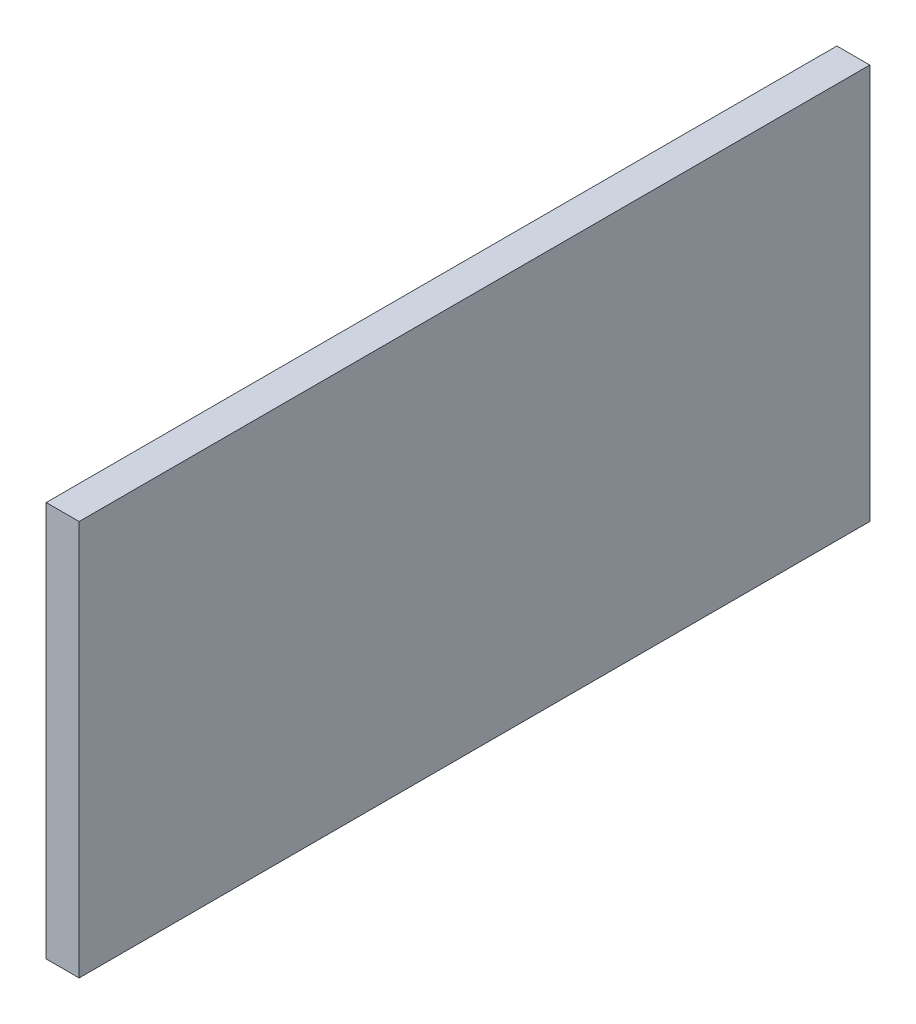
from build123d import *

# Parameters (mm, degrees)
BOSS_EXTRUDE1_DEPTH = 609.6
CUT_EXTRUDE1_REACH  = 1323.777
SKETCH2_W           = 50.8
SKETCH2_H           = 76.2
SKETCH3_W           = 76.2
SKETCH3_H           = 73.66
CUT_EXTRUDE2_DEPTH  = 50.8


with BuildPart() as part:
    # Sketch1 → Boss-Extrude1 (new body)
    with BuildSketch(Plane(origin=(0, 0, 0), x_dir=(1, 0, 0), z_dir=(0, 1, 0))):
        Polygon((0, 0), (50.8, 0), (50.8, -50.8), (101.6, -50.8), (101.6, 1168.4), (50.8, 1168.4), (50.8, 1117.6), (0, 1117.6), align=None)
    extrude(amount=BOSS_EXTRUDE1_DEPTH)

    # Sketch2 → Cut-Extrude1 (cut, up to next)
    with BuildSketch(Plane.XY, mode=Mode.PRIVATE) as cut_extrude1_sk1:
        with Locations((25.4, 571.5)):
            Rectangle(SKETCH2_W, SKETCH2_H)
    cut_extrude1_tool1 = extrude(cut_extrude1_sk1.sketch, amount=-CUT_EXTRUDE1_REACH, mode=Mode.PRIVATE) & part.part
    add(cut_extrude1_tool1.solids().sort_by_distance((25.4, 571.5, 0))[0], mode=Mode.SUBTRACT)

    # Sketch3 → Cut-Extrude2 (cut)
    with BuildSketch(Plane.ZY):
        with Locations((-355.485401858, 229.87)):
            Rectangle(SKETCH3_W, SKETCH3_H)
    extrude(amount=-CUT_EXTRUDE2_DEPTH, mode=Mode.SUBTRACT)


solid = part.part
